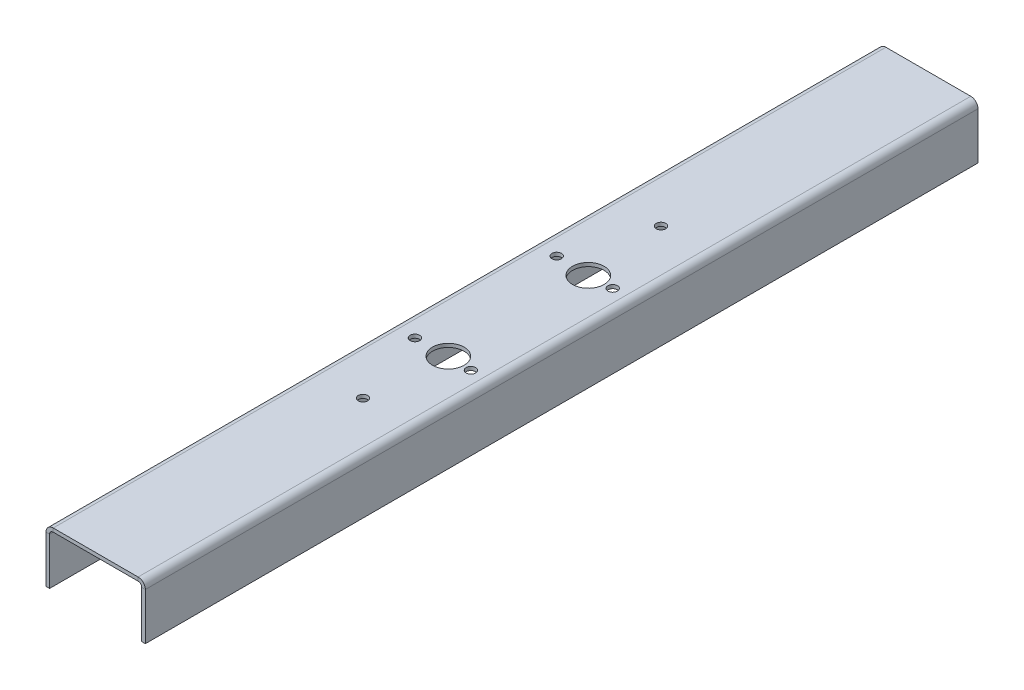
ISO-10303-21;
HEADER;
FILE_DESCRIPTION(('STEP AP214'),'2;1');
FILE_NAME('part.step','',(''),(''),'','','');
FILE_SCHEMA(('AUTOMOTIVE_DESIGN { 1 0 10303 214 1 1 1 1 }'));
ENDSEC;
DATA;
#1=APPLICATION_CONTEXT('core data for automotive mechanical design processes');
#2=APPLICATION_PROTOCOL_DEFINITION('international standard','automotive_design',2000,#1);
#3=PRODUCT_CONTEXT('',#1,'mechanical');
#4=PRODUCT('Part','Part','',(#3));
#5=PRODUCT_RELATED_PRODUCT_CATEGORY('part','',(#4));
#6=PRODUCT_DEFINITION_FORMATION('','',#4);
#7=PRODUCT_DEFINITION_CONTEXT('part definition',#1,'design');
#8=PRODUCT_DEFINITION('design','',#6,#7);
#9=PRODUCT_DEFINITION_SHAPE('','',#8);
#10=(LENGTH_UNIT() NAMED_UNIT(*) SI_UNIT(.MILLI.,.METRE.));
#11=(NAMED_UNIT(*) PLANE_ANGLE_UNIT() SI_UNIT($,.RADIAN.));
#12=(NAMED_UNIT(*) SI_UNIT($,.STERADIAN.) SOLID_ANGLE_UNIT());
#13=UNCERTAINTY_MEASURE_WITH_UNIT(LENGTH_MEASURE(1.E-05),#10,'distance_accuracy_value','');
#14=(GEOMETRIC_REPRESENTATION_CONTEXT(3) GLOBAL_UNCERTAINTY_ASSIGNED_CONTEXT((#13)) GLOBAL_UNIT_ASSIGNED_CONTEXT((#10,
#11,#12)) REPRESENTATION_CONTEXT('',''));
#15=CARTESIAN_POINT('',(0.,0.,0.));
#16=DIRECTION('',(0.,0.,1.));
#17=DIRECTION('',(1.,0.,0.));
#18=AXIS2_PLACEMENT_3D('',#15,#16,#17);
#19=CARTESIAN_POINT('',(55.0000000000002,-7.99999999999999,461.));
#20=DIRECTION('',(0.,0.,1.));
#21=DIRECTION('',(1.,0.,0.));
#22=AXIS2_PLACEMENT_3D('',#19,#20,#21);
#23=PLANE('',#22);
#24=DIRECTION('',(-1.,0.,0.));
#25=VECTOR('',#24,1.);
#26=CARTESIAN_POINT('',(55.0000000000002,-7.99999999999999,461.));
#27=LINE('',#26,#25);
#28=CARTESIAN_POINT('',(55.0000000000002,-7.99999999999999,461.));
#29=VERTEX_POINT('',#28);
#30=CARTESIAN_POINT('',(51.0000000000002,-7.99999999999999,461.));
#31=VERTEX_POINT('',#30);
#32=EDGE_CURVE('E11',#29,#31,#27,.T.);
#33=ORIENTED_EDGE('',*,*,#32,.F.);
#34=CARTESIAN_POINT('',(47.0000000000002,-7.99999999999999,461.));
#35=DIRECTION('',(0.,0.,-1.));
#36=DIRECTION('',(-1.,0.,0.));
#37=AXIS2_PLACEMENT_3D('',#34,#35,#36);
#38=CIRCLE('',#37,8.);
#39=CARTESIAN_POINT('',(47.0000000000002,0.,461.));
#40=VERTEX_POINT('',#39);
#41=EDGE_CURVE('E247',#29,#40,#38,.F.);
#42=ORIENTED_EDGE('',*,*,#41,.T.);
#43=DIRECTION('',(0.,1.,0.));
#44=VECTOR('',#43,1.);
#45=CARTESIAN_POINT('',(47.0000000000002,-3.99999999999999,461.));
#46=LINE('',#45,#44);
#47=CARTESIAN_POINT('',(47.0000000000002,-3.99999999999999,461.));
#48=VERTEX_POINT('',#47);
#49=EDGE_CURVE('E62',#48,#40,#46,.T.);
#50=ORIENTED_EDGE('',*,*,#49,.F.);
#51=CARTESIAN_POINT('',(47.0000000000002,-7.99999999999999,461.));
#52=DIRECTION('',(0.,0.,1.));
#53=DIRECTION('',(1.,0.,0.));
#54=AXIS2_PLACEMENT_3D('',#51,#52,#53);
#55=CIRCLE('',#54,4.);
#56=EDGE_CURVE('E231',#31,#48,#55,.T.);
#57=ORIENTED_EDGE('',*,*,#56,.F.);
#58=EDGE_LOOP('',(#33,#42,#50,#57));
#59=FACE_BOUND('',#58,.T.);
#60=ADVANCED_FACE('F54',(#59),#23,.T.);
#61=CARTESIAN_POINT('',(47.0000000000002,-3.99999999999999,461.));
#62=DIRECTION('',(0.,0.,1.));
#63=DIRECTION('',(1.,0.,0.));
#64=AXIS2_PLACEMENT_3D('',#61,#62,#63);
#65=PLANE('',#64);
#66=DIRECTION('',(0.,1.,0.));
#67=VECTOR('',#66,1.);
#68=CARTESIAN_POINT('',(55.0000000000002,0.,461.));
#69=LINE('',#68,#67);
#70=CARTESIAN_POINT('',(55.0000000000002,-60.,461.));
#71=VERTEX_POINT('',#70);
#72=EDGE_CURVE('E243',#71,#29,#69,.T.);
#73=ORIENTED_EDGE('',*,*,#72,.T.);
#74=ORIENTED_EDGE('',*,*,#32,.T.);
#75=DIRECTION('',(0.,1.,0.));
#76=VECTOR('',#75,1.);
#77=CARTESIAN_POINT('',(51.0000000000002,0.,461.));
#78=LINE('',#77,#76);
#79=CARTESIAN_POINT('',(51.0000000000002,-60.,461.));
#80=VERTEX_POINT('',#79);
#81=EDGE_CURVE('E235',#80,#31,#78,.T.);
#82=ORIENTED_EDGE('',*,*,#81,.F.);
#83=DIRECTION('',(-1.,0.,0.));
#84=VECTOR('',#83,1.);
#85=CARTESIAN_POINT('',(55.0000000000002,-60.,461.));
#86=LINE('',#85,#84);
#87=EDGE_CURVE('E239',#71,#80,#86,.T.);
#88=ORIENTED_EDGE('',*,*,#87,.F.);
#89=EDGE_LOOP('',(#73,#74,#82,#88));
#90=FACE_BOUND('',#89,.T.);
#91=ADVANCED_FACE('F351',(#90),#65,.T.);
#92=CARTESIAN_POINT('',(46.9999999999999,0.,-461.));
#93=DIRECTION('',(0.,0.,-1.));
#94=DIRECTION('',(-1.,0.,0.));
#95=AXIS2_PLACEMENT_3D('',#92,#93,#94);
#96=PLANE('',#95);
#97=DIRECTION('',(0.,-1.,0.));
#98=VECTOR('',#97,1.);
#99=CARTESIAN_POINT('',(46.9999999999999,0.,-461.));
#100=LINE('',#99,#98);
#101=CARTESIAN_POINT('',(46.9999999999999,0.,-461.));
#102=VERTEX_POINT('',#101);
#103=CARTESIAN_POINT('',(46.9999999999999,-3.99999999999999,-461.));
#104=VERTEX_POINT('',#103);
#105=EDGE_CURVE('E305',#102,#104,#100,.T.);
#106=ORIENTED_EDGE('',*,*,#105,.F.);
#107=CARTESIAN_POINT('',(46.9999999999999,-7.99999999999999,-461.));
#108=DIRECTION('',(0.,0.,-1.));
#109=DIRECTION('',(-1.,0.,0.));
#110=AXIS2_PLACEMENT_3D('',#107,#108,#109);
#111=CIRCLE('',#110,8.);
#112=CARTESIAN_POINT('',(54.9999999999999,-7.99999999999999,-461.));
#113=VERTEX_POINT('',#112);
#114=EDGE_CURVE('E202',#113,#102,#111,.F.);
#115=ORIENTED_EDGE('',*,*,#114,.F.);
#116=DIRECTION('',(1.,0.,0.));
#117=VECTOR('',#116,1.);
#118=CARTESIAN_POINT('',(50.9999999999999,-7.99999999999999,-461.));
#119=LINE('',#118,#117);
#120=CARTESIAN_POINT('',(50.9999999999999,-7.99999999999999,-461.));
#121=VERTEX_POINT('',#120);
#122=EDGE_CURVE('E302',#121,#113,#119,.T.);
#123=ORIENTED_EDGE('',*,*,#122,.F.);
#124=CARTESIAN_POINT('',(46.9999999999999,-7.99999999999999,-461.));
#125=DIRECTION('',(0.,0.,1.));
#126=DIRECTION('',(1.,0.,0.));
#127=AXIS2_PLACEMENT_3D('',#124,#125,#126);
#128=CIRCLE('',#127,4.);
#129=EDGE_CURVE('E186',#121,#104,#128,.T.);
#130=ORIENTED_EDGE('',*,*,#129,.T.);
#131=EDGE_LOOP('',(#106,#115,#123,#130));
#132=FACE_BOUND('',#131,.T.);
#133=ADVANCED_FACE('F361',(#132),#96,.T.);
#134=CARTESIAN_POINT('',(50.9999999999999,-7.99999999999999,-461.));
#135=DIRECTION('',(0.,0.,-1.));
#136=DIRECTION('',(-1.,0.,0.));
#137=AXIS2_PLACEMENT_3D('',#134,#135,#136);
#138=PLANE('',#137);
#139=DIRECTION('',(-1.,0.,0.));
#140=VECTOR('',#139,1.);
#141=CARTESIAN_POINT('',(-55.0000000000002,0.,-461.));
#142=LINE('',#141,#140);
#143=CARTESIAN_POINT('',(-47.0000000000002,0.,-461.));
#144=VERTEX_POINT('',#143);
#145=EDGE_CURVE('E206',#102,#144,#142,.T.);
#146=ORIENTED_EDGE('',*,*,#145,.F.);
#147=ORIENTED_EDGE('',*,*,#105,.T.);
#148=DIRECTION('',(-1.,0.,0.));
#149=VECTOR('',#148,1.);
#150=CARTESIAN_POINT('',(-55.0000000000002,-4.,-461.));
#151=LINE('',#150,#149);
#152=CARTESIAN_POINT('',(-47.0000000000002,-4.,-461.));
#153=VERTEX_POINT('',#152);
#154=EDGE_CURVE('E182',#104,#153,#151,.T.);
#155=ORIENTED_EDGE('',*,*,#154,.T.);
#156=DIRECTION('',(0.,1.,0.));
#157=VECTOR('',#156,1.);
#158=CARTESIAN_POINT('',(-47.0000000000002,-4.,-461.));
#159=LINE('',#158,#157);
#160=EDGE_CURVE('E154',#153,#144,#159,.T.);
#161=ORIENTED_EDGE('',*,*,#160,.T.);
#162=EDGE_LOOP('',(#146,#147,#155,#161));
#163=FACE_BOUND('',#162,.T.);
#164=ADVANCED_FACE('F363',(#163),#138,.T.);
#165=CARTESIAN_POINT('',(-46.9999999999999,0.,461.));
#166=DIRECTION('',(0.,0.,1.));
#167=DIRECTION('',(1.,0.,0.));
#168=AXIS2_PLACEMENT_3D('',#165,#166,#167);
#169=PLANE('',#168);
#170=DIRECTION('',(0.,-1.,0.));
#171=VECTOR('',#170,1.);
#172=CARTESIAN_POINT('',(-46.9999999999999,0.,461.));
#173=LINE('',#172,#171);
#174=CARTESIAN_POINT('',(-46.9999999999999,0.,461.));
#175=VERTEX_POINT('',#174);
#176=CARTESIAN_POINT('',(-46.9999999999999,-4.,461.));
#177=VERTEX_POINT('',#176);
#178=EDGE_CURVE('E76',#175,#177,#173,.T.);
#179=ORIENTED_EDGE('',*,*,#178,.F.);
#180=CARTESIAN_POINT('',(-46.9999999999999,-8.,461.));
#181=DIRECTION('',(0.,0.,-1.));
#182=DIRECTION('',(-1.,0.,0.));
#183=AXIS2_PLACEMENT_3D('',#180,#181,#182);
#184=CIRCLE('',#183,8.);
#185=CARTESIAN_POINT('',(-54.9999999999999,-8.,461.));
#186=VERTEX_POINT('',#185);
#187=EDGE_CURVE('E254',#175,#186,#184,.F.);
#188=ORIENTED_EDGE('',*,*,#187,.T.);
#189=DIRECTION('',(-1.,0.,0.));
#190=VECTOR('',#189,1.);
#191=CARTESIAN_POINT('',(-50.9999999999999,-8.,461.));
#192=LINE('',#191,#190);
#193=CARTESIAN_POINT('',(-50.9999999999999,-8.,461.));
#194=VERTEX_POINT('',#193);
#195=EDGE_CURVE('E69',#194,#186,#192,.T.);
#196=ORIENTED_EDGE('',*,*,#195,.F.);
#197=CARTESIAN_POINT('',(-46.9999999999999,-8.,461.));
#198=DIRECTION('',(0.,0.,1.));
#199=DIRECTION('',(1.,0.,0.));
#200=AXIS2_PLACEMENT_3D('',#197,#198,#199);
#201=CIRCLE('',#200,4.);
#202=EDGE_CURVE('E223',#177,#194,#201,.T.);
#203=ORIENTED_EDGE('',*,*,#202,.F.);
#204=EDGE_LOOP('',(#179,#188,#196,#203));
#205=FACE_BOUND('',#204,.T.);
#206=ADVANCED_FACE('F329',(#205),#169,.T.);
#207=CARTESIAN_POINT('',(-50.9999999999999,-8.,461.));
#208=DIRECTION('',(0.,0.,1.));
#209=DIRECTION('',(1.,0.,0.));
#210=AXIS2_PLACEMENT_3D('',#207,#208,#209);
#211=PLANE('',#210);
#212=DIRECTION('',(-1.,0.,0.));
#213=VECTOR('',#212,1.);
#214=CARTESIAN_POINT('',(-54.9999999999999,0.,461.));
#215=LINE('',#214,#213);
#216=EDGE_CURVE('E251',#40,#175,#215,.T.);
#217=ORIENTED_EDGE('',*,*,#216,.T.);
#218=ORIENTED_EDGE('',*,*,#178,.T.);
#219=DIRECTION('',(-1.,0.,0.));
#220=VECTOR('',#219,1.);
#221=CARTESIAN_POINT('',(-54.9999999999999,-4.,461.));
#222=LINE('',#221,#220);
#223=EDGE_CURVE('E227',#48,#177,#222,.T.);
#224=ORIENTED_EDGE('',*,*,#223,.F.);
#225=ORIENTED_EDGE('',*,*,#49,.T.);
#226=EDGE_LOOP('',(#217,#218,#224,#225));
#227=FACE_BOUND('',#226,.T.);
#228=ADVANCED_FACE('F311',(#227),#211,.T.);
#229=CARTESIAN_POINT('',(-55.0000000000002,-8.,-461.));
#230=DIRECTION('',(0.,0.,-1.));
#231=DIRECTION('',(-1.,0.,0.));
#232=AXIS2_PLACEMENT_3D('',#229,#230,#231);
#233=PLANE('',#232);
#234=DIRECTION('',(1.,0.,0.));
#235=VECTOR('',#234,1.);
#236=CARTESIAN_POINT('',(-55.0000000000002,-8.,-461.));
#237=LINE('',#236,#235);
#238=CARTESIAN_POINT('',(-55.0000000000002,-8.,-461.));
#239=VERTEX_POINT('',#238);
#240=CARTESIAN_POINT('',(-51.0000000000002,-8.,-461.));
#241=VERTEX_POINT('',#240);
#242=EDGE_CURVE('E295',#239,#241,#237,.T.);
#243=ORIENTED_EDGE('',*,*,#242,.F.);
#244=CARTESIAN_POINT('',(-47.0000000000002,-8.,-461.));
#245=DIRECTION('',(0.,0.,-1.));
#246=DIRECTION('',(-1.,0.,0.));
#247=AXIS2_PLACEMENT_3D('',#244,#245,#246);
#248=CIRCLE('',#247,8.);
#249=EDGE_CURVE('E210',#144,#239,#248,.F.);
#250=ORIENTED_EDGE('',*,*,#249,.F.);
#251=ORIENTED_EDGE('',*,*,#160,.F.);
#252=CARTESIAN_POINT('',(-47.0000000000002,-8.,-461.));
#253=DIRECTION('',(0.,0.,1.));
#254=DIRECTION('',(1.,0.,0.));
#255=AXIS2_PLACEMENT_3D('',#252,#253,#254);
#256=CIRCLE('',#255,4.);
#257=EDGE_CURVE('E175',#153,#241,#256,.T.);
#258=ORIENTED_EDGE('',*,*,#257,.T.);
#259=EDGE_LOOP('',(#243,#250,#251,#258));
#260=FACE_BOUND('',#259,.T.);
#261=ADVANCED_FACE('F365',(#260),#233,.T.);
#262=CARTESIAN_POINT('',(-47.0000000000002,-4.,-461.));
#263=DIRECTION('',(0.,0.,-1.));
#264=DIRECTION('',(-1.,0.,0.));
#265=AXIS2_PLACEMENT_3D('',#262,#263,#264);
#266=PLANE('',#265);
#267=DIRECTION('',(0.,-1.,0.));
#268=VECTOR('',#267,1.);
#269=CARTESIAN_POINT('',(-55.0000000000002,0.,-461.));
#270=LINE('',#269,#268);
#271=CARTESIAN_POINT('',(-55.0000000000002,-60.,-461.));
#272=VERTEX_POINT('',#271);
#273=EDGE_CURVE('E159',#239,#272,#270,.T.);
#274=ORIENTED_EDGE('',*,*,#273,.F.);
#275=ORIENTED_EDGE('',*,*,#242,.T.);
#276=DIRECTION('',(0.,1.,0.));
#277=VECTOR('',#276,1.);
#278=CARTESIAN_POINT('',(-51.0000000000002,0.,-461.));
#279=LINE('',#278,#277);
#280=CARTESIAN_POINT('',(-51.0000000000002,-60.,-461.));
#281=VERTEX_POINT('',#280);
#282=EDGE_CURVE('E169',#241,#281,#279,.F.);
#283=ORIENTED_EDGE('',*,*,#282,.T.);
#284=DIRECTION('',(-1.,0.,0.));
#285=VECTOR('',#284,1.);
#286=CARTESIAN_POINT('',(-51.0000000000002,-60.,-461.));
#287=LINE('',#286,#285);
#288=EDGE_CURVE('E147',#281,#272,#287,.T.);
#289=ORIENTED_EDGE('',*,*,#288,.T.);
#290=EDGE_LOOP('',(#274,#275,#283,#289));
#291=FACE_BOUND('',#290,.T.);
#292=ADVANCED_FACE('F167',(#291),#266,.T.);
#293=CARTESIAN_POINT('',(-54.9999999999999,0.,461.));
#294=DIRECTION('',(1.,0.,0.));
#295=DIRECTION('',(0.,0.,-1.));
#296=AXIS2_PLACEMENT_3D('',#293,#294,#295);
#297=PLANE('',#296);
#298=ORIENTED_EDGE('',*,*,#273,.T.);
#299=DIRECTION('',(0.,0.,-1.));
#300=VECTOR('',#299,1.);
#301=CARTESIAN_POINT('',(-54.9999999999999,-60.,461.));
#302=LINE('',#301,#300);
#303=CARTESIAN_POINT('',(-54.9999999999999,-60.,461.));
#304=VERTEX_POINT('',#303);
#305=EDGE_CURVE('E143',#304,#272,#302,.T.);
#306=ORIENTED_EDGE('',*,*,#305,.F.);
#307=DIRECTION('',(0.,-1.,0.));
#308=VECTOR('',#307,1.);
#309=CARTESIAN_POINT('',(-54.9999999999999,0.,461.));
#310=LINE('',#309,#308);
#311=EDGE_CURVE('E214',#186,#304,#310,.T.);
#312=ORIENTED_EDGE('',*,*,#311,.F.);
#313=DIRECTION('',(0.,0.,-1.));
#314=VECTOR('',#313,1.);
#315=CARTESIAN_POINT('',(-54.9999999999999,-8.,461.));
#316=LINE('',#315,#314);
#317=EDGE_CURVE('E162',#186,#239,#316,.T.);
#318=ORIENTED_EDGE('',*,*,#317,.T.);
#319=EDGE_LOOP('',(#298,#306,#312,#318));
#320=FACE_BOUND('',#319,.T.);
#321=ADVANCED_FACE('F160',(#320),#297,.F.);
#322=CARTESIAN_POINT('',(-50.9999999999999,-60.,461.));
#323=DIRECTION('',(0.,-1.,0.));
#324=DIRECTION('',(0.,0.,-1.));
#325=AXIS2_PLACEMENT_3D('',#322,#323,#324);
#326=PLANE('',#325);
#327=ORIENTED_EDGE('',*,*,#288,.F.);
#328=DIRECTION('',(0.,0.,-1.));
#329=VECTOR('',#328,1.);
#330=CARTESIAN_POINT('',(-50.9999999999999,-60.,461.));
#331=LINE('',#330,#329);
#332=CARTESIAN_POINT('',(-50.9999999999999,-60.,461.));
#333=VERTEX_POINT('',#332);
#334=EDGE_CURVE('E155',#333,#281,#331,.T.);
#335=ORIENTED_EDGE('',*,*,#334,.F.);
#336=DIRECTION('',(-1.,0.,0.));
#337=VECTOR('',#336,1.);
#338=CARTESIAN_POINT('',(-50.9999999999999,-60.,461.));
#339=LINE('',#338,#337);
#340=EDGE_CURVE('E150',#333,#304,#339,.T.);
#341=ORIENTED_EDGE('',*,*,#340,.T.);
#342=ORIENTED_EDGE('',*,*,#305,.T.);
#343=EDGE_LOOP('',(#327,#335,#341,#342));
#344=FACE_BOUND('',#343,.T.);
#345=ADVANCED_FACE('F145',(#344),#326,.T.);
#346=CARTESIAN_POINT('',(-50.9999999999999,0.,461.));
#347=DIRECTION('',(1.,0.,0.));
#348=DIRECTION('',(0.,0.,-1.));
#349=AXIS2_PLACEMENT_3D('',#346,#347,#348);
#350=PLANE('',#349);
#351=ORIENTED_EDGE('',*,*,#282,.F.);
#352=DIRECTION('',(0.,0.,-1.));
#353=VECTOR('',#352,1.);
#354=CARTESIAN_POINT('',(-50.9999999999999,-8.,461.));
#355=LINE('',#354,#353);
#356=EDGE_CURVE('E289',#194,#241,#355,.T.);
#357=ORIENTED_EDGE('',*,*,#356,.F.);
#358=DIRECTION('',(0.,1.,0.));
#359=VECTOR('',#358,1.);
#360=CARTESIAN_POINT('',(-50.9999999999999,0.,461.));
#361=LINE('',#360,#359);
#362=EDGE_CURVE('E219',#194,#333,#361,.F.);
#363=ORIENTED_EDGE('',*,*,#362,.T.);
#364=ORIENTED_EDGE('',*,*,#334,.T.);
#365=EDGE_LOOP('',(#351,#357,#363,#364));
#366=FACE_BOUND('',#365,.T.);
#367=ADVANCED_FACE('F332',(#366),#350,.T.);
#368=CARTESIAN_POINT('',(-46.9999999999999,-8.,461.));
#369=DIRECTION('',(0.,0.,-1.));
#370=DIRECTION('',(-1.,0.,0.));
#371=AXIS2_PLACEMENT_3D('',#368,#369,#370);
#372=CYLINDRICAL_SURFACE('',#371,4.);
#373=ORIENTED_EDGE('',*,*,#257,.F.);
#374=DIRECTION('',(0.,0.,-1.));
#375=VECTOR('',#374,1.);
#376=CARTESIAN_POINT('',(-46.9999999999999,-4.,461.));
#377=LINE('',#376,#375);
#378=EDGE_CURVE('E285',#177,#153,#377,.T.);
#379=ORIENTED_EDGE('',*,*,#378,.F.);
#380=ORIENTED_EDGE('',*,*,#202,.T.);
#381=ORIENTED_EDGE('',*,*,#356,.T.);
#382=EDGE_LOOP('',(#373,#379,#380,#381));
#383=FACE_BOUND('',#382,.T.);
#384=ADVANCED_FACE('F337',(#383),#372,.F.);
#385=CARTESIAN_POINT('',(-54.9999999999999,-4.,461.));
#386=DIRECTION('',(0.,-1.,0.));
#387=DIRECTION('',(1.,0.,0.));
#388=AXIS2_PLACEMENT_3D('',#385,#386,#387);
#389=PLANE('',#388);
#390=CARTESIAN_POINT('',(2.22044604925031E-13,-3.99999999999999,-165.));
#391=DIRECTION('',(0.,-1.,0.));
#392=DIRECTION('',(1.,0.,0.));
#393=AXIS2_PLACEMENT_3D('',#390,#391,#392);
#394=CIRCLE('',#393,5.25);
#395=CARTESIAN_POINT('',(5.25000000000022,-3.99999999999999,-165.));
#396=VERTEX_POINT('',#395);
#397=EDGE_CURVE('E717',#396,#396,#394,.F.);
#398=ORIENTED_EDGE('',*,*,#397,.T.);
#399=EDGE_LOOP('',(#398));
#400=FACE_BOUND('',#399,.T.);
#401=CARTESIAN_POINT('',(0.,-3.99999999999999,165.));
#402=DIRECTION('',(0.,-1.,0.));
#403=DIRECTION('',(1.,0.,0.));
#404=AXIS2_PLACEMENT_3D('',#401,#402,#403);
#405=CIRCLE('',#404,5.25);
#406=CARTESIAN_POINT('',(5.25,-3.99999999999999,165.));
#407=VERTEX_POINT('',#406);
#408=EDGE_CURVE('E722',#407,#407,#405,.F.);
#409=ORIENTED_EDGE('',*,*,#408,.T.);
#410=EDGE_LOOP('',(#409));
#411=FACE_BOUND('',#410,.T.);
#412=CARTESIAN_POINT('',(-29.0000000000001,-4.,-78.5));
#413=DIRECTION('',(0.,-1.,0.));
#414=DIRECTION('',(1.,0.,0.));
#415=AXIS2_PLACEMENT_3D('',#412,#413,#414);
#416=CIRCLE('',#415,5.25);
#417=CARTESIAN_POINT('',(-23.7500000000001,-4.,-78.5));
#418=VERTEX_POINT('',#417);
#419=EDGE_CURVE('E732',#418,#418,#416,.F.);
#420=ORIENTED_EDGE('',*,*,#419,.T.);
#421=EDGE_LOOP('',(#420));
#422=FACE_BOUND('',#421,.T.);
#423=CARTESIAN_POINT('',(-28.9999999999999,-4.,78.5));
#424=DIRECTION('',(0.,-1.,0.));
#425=DIRECTION('',(1.,0.,0.));
#426=AXIS2_PLACEMENT_3D('',#423,#424,#425);
#427=CIRCLE('',#426,5.25);
#428=CARTESIAN_POINT('',(-23.7499999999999,-4.,78.5));
#429=VERTEX_POINT('',#428);
#430=EDGE_CURVE('E738',#429,#429,#427,.F.);
#431=ORIENTED_EDGE('',*,*,#430,.T.);
#432=EDGE_LOOP('',(#431));
#433=FACE_BOUND('',#432,.T.);
#434=CARTESIAN_POINT('',(32.9999999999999,-3.99999999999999,-78.5));
#435=DIRECTION('',(0.,-1.,0.));
#436=DIRECTION('',(1.,0.,0.));
#437=AXIS2_PLACEMENT_3D('',#434,#435,#436);
#438=CIRCLE('',#437,5.25);
#439=CARTESIAN_POINT('',(38.2499999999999,-3.99999999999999,-78.5));
#440=VERTEX_POINT('',#439);
#441=EDGE_CURVE('E746',#440,#440,#438,.F.);
#442=ORIENTED_EDGE('',*,*,#441,.T.);
#443=EDGE_LOOP('',(#442));
#444=FACE_BOUND('',#443,.T.);
#445=CARTESIAN_POINT('',(6.9999999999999,-3.99999999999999,-77.5));
#446=DIRECTION('',(0.,-1.,0.));
#447=DIRECTION('',(1.,0.,0.));
#448=AXIS2_PLACEMENT_3D('',#445,#446,#447);
#449=CIRCLE('',#448,17.5);
#450=CARTESIAN_POINT('',(24.4999999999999,-3.99999999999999,-77.5));
#451=VERTEX_POINT('',#450);
#452=EDGE_CURVE('E754',#451,#451,#449,.F.);
#453=ORIENTED_EDGE('',*,*,#452,.T.);
#454=EDGE_LOOP('',(#453));
#455=FACE_BOUND('',#454,.T.);
#456=CARTESIAN_POINT('',(33.0000000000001,-3.99999999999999,78.5));
#457=DIRECTION('',(0.,-1.,0.));
#458=DIRECTION('',(1.,0.,0.));
#459=AXIS2_PLACEMENT_3D('',#456,#457,#458);
#460=CIRCLE('',#459,5.25);
#461=CARTESIAN_POINT('',(38.2500000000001,-3.99999999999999,78.5));
#462=VERTEX_POINT('',#461);
#463=EDGE_CURVE('E762',#462,#462,#460,.F.);
#464=ORIENTED_EDGE('',*,*,#463,.T.);
#465=EDGE_LOOP('',(#464));
#466=FACE_BOUND('',#465,.T.);
#467=CARTESIAN_POINT('',(7.00000000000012,-3.99999999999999,77.5));
#468=DIRECTION('',(0.,-1.,0.));
#469=DIRECTION('',(1.,0.,0.));
#470=AXIS2_PLACEMENT_3D('',#467,#468,#469);
#471=CIRCLE('',#470,17.5);
#472=CARTESIAN_POINT('',(24.5000000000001,-3.99999999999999,77.5));
#473=VERTEX_POINT('',#472);
#474=EDGE_CURVE('E770',#473,#473,#471,.F.);
#475=ORIENTED_EDGE('',*,*,#474,.T.);
#476=EDGE_LOOP('',(#475));
#477=FACE_BOUND('',#476,.T.);
#478=ORIENTED_EDGE('',*,*,#154,.F.);
#479=DIRECTION('',(0.,0.,-1.));
#480=VECTOR('',#479,1.);
#481=CARTESIAN_POINT('',(47.0000000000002,-3.99999999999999,461.));
#482=LINE('',#481,#480);
#483=EDGE_CURVE('E281',#48,#104,#482,.T.);
#484=ORIENTED_EDGE('',*,*,#483,.F.);
#485=ORIENTED_EDGE('',*,*,#223,.T.);
#486=ORIENTED_EDGE('',*,*,#378,.T.);
#487=EDGE_LOOP('',(#478,#484,#485,#486));
#488=FACE_BOUND('',#487,.T.);
#489=ADVANCED_FACE('F340',(#400,#411,#422,#433,#444,#455,#466,#477,#488),#389,.T.);
#490=CARTESIAN_POINT('',(47.0000000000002,-7.99999999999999,461.));
#491=DIRECTION('',(0.,0.,-1.));
#492=DIRECTION('',(-1.,0.,0.));
#493=AXIS2_PLACEMENT_3D('',#490,#491,#492);
#494=CYLINDRICAL_SURFACE('',#493,4.);
#495=ORIENTED_EDGE('',*,*,#129,.F.);
#496=DIRECTION('',(0.,0.,-1.));
#497=VECTOR('',#496,1.);
#498=CARTESIAN_POINT('',(51.0000000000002,-7.99999999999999,461.));
#499=LINE('',#498,#497);
#500=EDGE_CURVE('E277',#31,#121,#499,.T.);
#501=ORIENTED_EDGE('',*,*,#500,.F.);
#502=ORIENTED_EDGE('',*,*,#56,.T.);
#503=ORIENTED_EDGE('',*,*,#483,.T.);
#504=EDGE_LOOP('',(#495,#501,#502,#503));
#505=FACE_BOUND('',#504,.T.);
#506=ADVANCED_FACE('F343',(#505),#494,.F.);
#507=CARTESIAN_POINT('',(51.0000000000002,0.,461.));
#508=DIRECTION('',(-1.,0.,0.));
#509=DIRECTION('',(0.,-1.,0.));
#510=AXIS2_PLACEMENT_3D('',#507,#508,#509);
#511=PLANE('',#510);
#512=DIRECTION('',(0.,1.,0.));
#513=VECTOR('',#512,1.);
#514=CARTESIAN_POINT('',(50.9999999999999,0.,-461.));
#515=LINE('',#514,#513);
#516=CARTESIAN_POINT('',(50.9999999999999,-60.,-461.));
#517=VERTEX_POINT('',#516);
#518=EDGE_CURVE('E190',#517,#121,#515,.T.);
#519=ORIENTED_EDGE('',*,*,#518,.F.);
#520=DIRECTION('',(0.,0.,-1.));
#521=VECTOR('',#520,1.);
#522=CARTESIAN_POINT('',(51.0000000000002,-60.,461.));
#523=LINE('',#522,#521);
#524=EDGE_CURVE('E274',#80,#517,#523,.T.);
#525=ORIENTED_EDGE('',*,*,#524,.F.);
#526=ORIENTED_EDGE('',*,*,#81,.T.);
#527=ORIENTED_EDGE('',*,*,#500,.T.);
#528=EDGE_LOOP('',(#519,#525,#526,#527));
#529=FACE_BOUND('',#528,.T.);
#530=ADVANCED_FACE('F348',(#529),#511,.T.);
#531=CARTESIAN_POINT('',(55.0000000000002,-60.,461.));
#532=DIRECTION('',(0.,-1.,0.));
#533=DIRECTION('',(0.,0.,-1.));
#534=AXIS2_PLACEMENT_3D('',#531,#532,#533);
#535=PLANE('',#534);
#536=DIRECTION('',(-1.,0.,0.));
#537=VECTOR('',#536,1.);
#538=CARTESIAN_POINT('',(54.9999999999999,-60.,-461.));
#539=LINE('',#538,#537);
#540=CARTESIAN_POINT('',(54.9999999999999,-60.,-461.));
#541=VERTEX_POINT('',#540);
#542=EDGE_CURVE('E194',#541,#517,#539,.T.);
#543=ORIENTED_EDGE('',*,*,#542,.F.);
#544=DIRECTION('',(0.,0.,-1.));
#545=VECTOR('',#544,1.);
#546=CARTESIAN_POINT('',(55.0000000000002,-60.,461.));
#547=LINE('',#546,#545);
#548=EDGE_CURVE('E271',#71,#541,#547,.T.);
#549=ORIENTED_EDGE('',*,*,#548,.F.);
#550=ORIENTED_EDGE('',*,*,#87,.T.);
#551=ORIENTED_EDGE('',*,*,#524,.T.);
#552=EDGE_LOOP('',(#543,#549,#550,#551));
#553=FACE_BOUND('',#552,.T.);
#554=ADVANCED_FACE('F354',(#553),#535,.T.);
#555=CARTESIAN_POINT('',(55.0000000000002,0.,461.));
#556=DIRECTION('',(-1.,0.,0.));
#557=DIRECTION('',(0.,-1.,0.));
#558=AXIS2_PLACEMENT_3D('',#555,#556,#557);
#559=PLANE('',#558);
#560=DIRECTION('',(0.,1.,0.));
#561=VECTOR('',#560,1.);
#562=CARTESIAN_POINT('',(54.9999999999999,0.,-461.));
#563=LINE('',#562,#561);
#564=EDGE_CURVE('E198',#541,#113,#563,.T.);
#565=ORIENTED_EDGE('',*,*,#564,.T.);
#566=DIRECTION('',(0.,0.,-1.));
#567=VECTOR('',#566,1.);
#568=CARTESIAN_POINT('',(55.0000000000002,-7.99999999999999,461.));
#569=LINE('',#568,#567);
#570=EDGE_CURVE('E267',#29,#113,#569,.T.);
#571=ORIENTED_EDGE('',*,*,#570,.F.);
#572=ORIENTED_EDGE('',*,*,#72,.F.);
#573=ORIENTED_EDGE('',*,*,#548,.T.);
#574=EDGE_LOOP('',(#565,#571,#572,#573));
#575=FACE_BOUND('',#574,.T.);
#576=ADVANCED_FACE('F359',(#575),#559,.F.);
#577=CARTESIAN_POINT('',(47.0000000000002,-7.99999999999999,461.));
#578=DIRECTION('',(0.,0.,-1.));
#579=DIRECTION('',(-1.,0.,0.));
#580=AXIS2_PLACEMENT_3D('',#577,#578,#579);
#581=CYLINDRICAL_SURFACE('',#580,8.);
#582=ORIENTED_EDGE('',*,*,#114,.T.);
#583=DIRECTION('',(0.,0.,-1.));
#584=VECTOR('',#583,1.);
#585=CARTESIAN_POINT('',(47.0000000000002,0.,461.));
#586=LINE('',#585,#584);
#587=EDGE_CURVE('E263',#40,#102,#586,.T.);
#588=ORIENTED_EDGE('',*,*,#587,.F.);
#589=ORIENTED_EDGE('',*,*,#41,.F.);
#590=ORIENTED_EDGE('',*,*,#570,.T.);
#591=EDGE_LOOP('',(#582,#588,#589,#590));
#592=FACE_BOUND('',#591,.T.);
#593=ADVANCED_FACE('F320',(#592),#581,.T.);
#594=CARTESIAN_POINT('',(-54.9999999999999,0.,461.));
#595=DIRECTION('',(0.,-1.,0.));
#596=DIRECTION('',(1.,0.,0.));
#597=AXIS2_PLACEMENT_3D('',#594,#595,#596);
#598=PLANE('',#597);
#599=CARTESIAN_POINT('',(2.22044604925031E-13,0.,-165.));
#600=DIRECTION('',(0.,1.,0.));
#601=DIRECTION('',(1.,0.,0.));
#602=AXIS2_PLACEMENT_3D('',#599,#600,#601);
#603=CIRCLE('',#602,5.25);
#604=CARTESIAN_POINT('',(5.25000000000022,0.,-165.));
#605=VERTEX_POINT('',#604);
#606=EDGE_CURVE('E720',#605,#605,#603,.T.);
#607=ORIENTED_EDGE('',*,*,#606,.F.);
#608=EDGE_LOOP('',(#607));
#609=FACE_BOUND('',#608,.T.);
#610=CARTESIAN_POINT('',(0.,0.,165.));
#611=DIRECTION('',(0.,1.,0.));
#612=DIRECTION('',(-1.,0.,0.));
#613=AXIS2_PLACEMENT_3D('',#610,#611,#612);
#614=CIRCLE('',#613,5.25);
#615=CARTESIAN_POINT('',(-5.25,0.,165.));
#616=VERTEX_POINT('',#615);
#617=EDGE_CURVE('E726',#616,#616,#614,.T.);
#618=ORIENTED_EDGE('',*,*,#617,.F.);
#619=EDGE_LOOP('',(#618));
#620=FACE_BOUND('',#619,.T.);
#621=CARTESIAN_POINT('',(-29.0000000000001,0.,-78.5));
#622=DIRECTION('',(0.,1.,0.));
#623=DIRECTION('',(1.,0.,0.));
#624=AXIS2_PLACEMENT_3D('',#621,#622,#623);
#625=CIRCLE('',#624,5.25);
#626=CARTESIAN_POINT('',(-23.7500000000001,0.,-78.5));
#627=VERTEX_POINT('',#626);
#628=EDGE_CURVE('E734',#627,#627,#625,.T.);
#629=ORIENTED_EDGE('',*,*,#628,.F.);
#630=EDGE_LOOP('',(#629));
#631=FACE_BOUND('',#630,.T.);
#632=CARTESIAN_POINT('',(-28.9999999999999,0.,78.5));
#633=DIRECTION('',(0.,1.,0.));
#634=DIRECTION('',(-1.,0.,0.));
#635=AXIS2_PLACEMENT_3D('',#632,#633,#634);
#636=CIRCLE('',#635,5.25);
#637=CARTESIAN_POINT('',(-34.2499999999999,0.,78.5));
#638=VERTEX_POINT('',#637);
#639=EDGE_CURVE('E742',#638,#638,#636,.T.);
#640=ORIENTED_EDGE('',*,*,#639,.F.);
#641=EDGE_LOOP('',(#640));
#642=FACE_BOUND('',#641,.T.);
#643=CARTESIAN_POINT('',(32.9999999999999,0.,-78.5));
#644=DIRECTION('',(0.,1.,0.));
#645=DIRECTION('',(1.,0.,0.));
#646=AXIS2_PLACEMENT_3D('',#643,#644,#645);
#647=CIRCLE('',#646,5.25);
#648=CARTESIAN_POINT('',(38.2499999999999,0.,-78.5));
#649=VERTEX_POINT('',#648);
#650=EDGE_CURVE('E750',#649,#649,#647,.T.);
#651=ORIENTED_EDGE('',*,*,#650,.F.);
#652=EDGE_LOOP('',(#651));
#653=FACE_BOUND('',#652,.T.);
#654=CARTESIAN_POINT('',(6.9999999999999,0.,-77.5));
#655=DIRECTION('',(0.,1.,0.));
#656=DIRECTION('',(1.,0.,0.));
#657=AXIS2_PLACEMENT_3D('',#654,#655,#656);
#658=CIRCLE('',#657,17.5);
#659=CARTESIAN_POINT('',(24.4999999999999,0.,-77.5));
#660=VERTEX_POINT('',#659);
#661=EDGE_CURVE('E758',#660,#660,#658,.T.);
#662=ORIENTED_EDGE('',*,*,#661,.F.);
#663=EDGE_LOOP('',(#662));
#664=FACE_BOUND('',#663,.T.);
#665=CARTESIAN_POINT('',(33.0000000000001,0.,78.5));
#666=DIRECTION('',(0.,1.,0.));
#667=DIRECTION('',(-1.,0.,0.));
#668=AXIS2_PLACEMENT_3D('',#665,#666,#667);
#669=CIRCLE('',#668,5.25);
#670=CARTESIAN_POINT('',(27.7500000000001,0.,78.5));
#671=VERTEX_POINT('',#670);
#672=EDGE_CURVE('E766',#671,#671,#669,.T.);
#673=ORIENTED_EDGE('',*,*,#672,.F.);
#674=EDGE_LOOP('',(#673));
#675=FACE_BOUND('',#674,.T.);
#676=CARTESIAN_POINT('',(7.00000000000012,0.,77.5));
#677=DIRECTION('',(0.,1.,0.));
#678=DIRECTION('',(-1.,0.,0.));
#679=AXIS2_PLACEMENT_3D('',#676,#677,#678);
#680=CIRCLE('',#679,17.5);
#681=CARTESIAN_POINT('',(-10.4999999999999,0.,77.5));
#682=VERTEX_POINT('',#681);
#683=EDGE_CURVE('E165',#682,#682,#680,.T.);
#684=ORIENTED_EDGE('',*,*,#683,.F.);
#685=EDGE_LOOP('',(#684));
#686=FACE_BOUND('',#685,.T.);
#687=ORIENTED_EDGE('',*,*,#145,.T.);
#688=DIRECTION('',(0.,0.,-1.));
#689=VECTOR('',#688,1.);
#690=CARTESIAN_POINT('',(-46.9999999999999,0.,461.));
#691=LINE('',#690,#689);
#692=EDGE_CURVE('E259',#175,#144,#691,.T.);
#693=ORIENTED_EDGE('',*,*,#692,.F.);
#694=ORIENTED_EDGE('',*,*,#216,.F.);
#695=ORIENTED_EDGE('',*,*,#587,.T.);
#696=EDGE_LOOP('',(#687,#693,#694,#695));
#697=FACE_BOUND('',#696,.T.);
#698=ADVANCED_FACE('F324',(#609,#620,#631,#642,#653,#664,#675,#686,#697),#598,.F.);
#699=CARTESIAN_POINT('',(-46.9999999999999,-8.,461.));
#700=DIRECTION('',(0.,0.,-1.));
#701=DIRECTION('',(-1.,0.,0.));
#702=AXIS2_PLACEMENT_3D('',#699,#700,#701);
#703=CYLINDRICAL_SURFACE('',#702,8.);
#704=ORIENTED_EDGE('',*,*,#249,.T.);
#705=ORIENTED_EDGE('',*,*,#317,.F.);
#706=ORIENTED_EDGE('',*,*,#187,.F.);
#707=ORIENTED_EDGE('',*,*,#692,.T.);
#708=EDGE_LOOP('',(#704,#705,#706,#707));
#709=FACE_BOUND('',#708,.T.);
#710=ADVANCED_FACE('F328',(#709),#703,.T.);
#711=CARTESIAN_POINT('',(-46.9999999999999,-8.,461.));
#712=DIRECTION('',(0.,0.,1.));
#713=DIRECTION('',(1.,0.,0.));
#714=AXIS2_PLACEMENT_3D('',#711,#712,#713);
#715=PLANE('',#714);
#716=ORIENTED_EDGE('',*,*,#311,.T.);
#717=ORIENTED_EDGE('',*,*,#340,.F.);
#718=ORIENTED_EDGE('',*,*,#362,.F.);
#719=ORIENTED_EDGE('',*,*,#195,.T.);
#720=EDGE_LOOP('',(#716,#717,#718,#719));
#721=FACE_BOUND('',#720,.T.);
#722=ADVANCED_FACE('F335',(#721),#715,.T.);
#723=CARTESIAN_POINT('',(-47.0000000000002,-8.,-461.));
#724=DIRECTION('',(0.,0.,1.));
#725=DIRECTION('',(1.,0.,0.));
#726=AXIS2_PLACEMENT_3D('',#723,#724,#725);
#727=PLANE('',#726);
#728=ORIENTED_EDGE('',*,*,#518,.T.);
#729=ORIENTED_EDGE('',*,*,#122,.T.);
#730=ORIENTED_EDGE('',*,*,#564,.F.);
#731=ORIENTED_EDGE('',*,*,#542,.T.);
#732=EDGE_LOOP('',(#728,#729,#730,#731));
#733=FACE_BOUND('',#732,.T.);
#734=ADVANCED_FACE('F494',(#733),#727,.F.);
#735=CARTESIAN_POINT('',(7.00000000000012,-60.001,77.5));
#736=DIRECTION('',(0.,1.,0.));
#737=DIRECTION('',(-1.,0.,0.));
#738=AXIS2_PLACEMENT_3D('',#735,#736,#737);
#739=CYLINDRICAL_SURFACE('',#738,17.5);
#740=ORIENTED_EDGE('',*,*,#474,.F.);
#741=EDGE_LOOP('',(#740));
#742=FACE_BOUND('',#741,.T.);
#743=ORIENTED_EDGE('',*,*,#683,.T.);
#744=EDGE_LOOP('',(#743));
#745=FACE_BOUND('',#744,.T.);
#746=ADVANCED_FACE('F502',(#742,#745),#739,.F.);
#747=CARTESIAN_POINT('',(33.0000000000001,-60.001,78.5));
#748=DIRECTION('',(0.,1.,0.));
#749=DIRECTION('',(-1.,0.,0.));
#750=AXIS2_PLACEMENT_3D('',#747,#748,#749);
#751=CYLINDRICAL_SURFACE('',#750,5.25);
#752=ORIENTED_EDGE('',*,*,#463,.F.);
#753=EDGE_LOOP('',(#752));
#754=FACE_BOUND('',#753,.T.);
#755=ORIENTED_EDGE('',*,*,#672,.T.);
#756=EDGE_LOOP('',(#755));
#757=FACE_BOUND('',#756,.T.);
#758=ADVANCED_FACE('F511',(#754,#757),#751,.F.);
#759=CARTESIAN_POINT('',(6.9999999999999,-60.001,-77.5));
#760=DIRECTION('',(0.,1.,0.));
#761=DIRECTION('',(-1.,0.,0.));
#762=AXIS2_PLACEMENT_3D('',#759,#760,#761);
#763=CYLINDRICAL_SURFACE('',#762,17.5);
#764=ORIENTED_EDGE('',*,*,#452,.F.);
#765=EDGE_LOOP('',(#764));
#766=FACE_BOUND('',#765,.T.);
#767=ORIENTED_EDGE('',*,*,#661,.T.);
#768=EDGE_LOOP('',(#767));
#769=FACE_BOUND('',#768,.T.);
#770=ADVANCED_FACE('F520',(#766,#769),#763,.F.);
#771=CARTESIAN_POINT('',(32.9999999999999,-60.001,-78.5));
#772=DIRECTION('',(0.,1.,0.));
#773=DIRECTION('',(-1.,0.,0.));
#774=AXIS2_PLACEMENT_3D('',#771,#772,#773);
#775=CYLINDRICAL_SURFACE('',#774,5.25);
#776=ORIENTED_EDGE('',*,*,#441,.F.);
#777=EDGE_LOOP('',(#776));
#778=FACE_BOUND('',#777,.T.);
#779=ORIENTED_EDGE('',*,*,#650,.T.);
#780=EDGE_LOOP('',(#779));
#781=FACE_BOUND('',#780,.T.);
#782=ADVANCED_FACE('F529',(#778,#781),#775,.F.);
#783=CARTESIAN_POINT('',(-28.9999999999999,-60.001,78.5));
#784=DIRECTION('',(0.,1.,0.));
#785=DIRECTION('',(-1.,0.,0.));
#786=AXIS2_PLACEMENT_3D('',#783,#784,#785);
#787=CYLINDRICAL_SURFACE('',#786,5.25);
#788=ORIENTED_EDGE('',*,*,#430,.F.);
#789=EDGE_LOOP('',(#788));
#790=FACE_BOUND('',#789,.T.);
#791=ORIENTED_EDGE('',*,*,#639,.T.);
#792=EDGE_LOOP('',(#791));
#793=FACE_BOUND('',#792,.T.);
#794=ADVANCED_FACE('F538',(#790,#793),#787,.F.);
#795=CARTESIAN_POINT('',(-29.0000000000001,-60.001,-78.5));
#796=DIRECTION('',(0.,1.,0.));
#797=DIRECTION('',(-1.,0.,0.));
#798=AXIS2_PLACEMENT_3D('',#795,#796,#797);
#799=CYLINDRICAL_SURFACE('',#798,5.25);
#800=ORIENTED_EDGE('',*,*,#419,.F.);
#801=EDGE_LOOP('',(#800));
#802=FACE_BOUND('',#801,.T.);
#803=ORIENTED_EDGE('',*,*,#628,.T.);
#804=EDGE_LOOP('',(#803));
#805=FACE_BOUND('',#804,.T.);
#806=ADVANCED_FACE('F547',(#802,#805),#799,.F.);
#807=CARTESIAN_POINT('',(0.,-60.001,165.));
#808=DIRECTION('',(0.,1.,0.));
#809=DIRECTION('',(-1.,0.,0.));
#810=AXIS2_PLACEMENT_3D('',#807,#808,#809);
#811=CYLINDRICAL_SURFACE('',#810,5.25);
#812=ORIENTED_EDGE('',*,*,#408,.F.);
#813=EDGE_LOOP('',(#812));
#814=FACE_BOUND('',#813,.T.);
#815=ORIENTED_EDGE('',*,*,#617,.T.);
#816=EDGE_LOOP('',(#815));
#817=FACE_BOUND('',#816,.T.);
#818=ADVANCED_FACE('F556',(#814,#817),#811,.F.);
#819=CARTESIAN_POINT('',(2.22044604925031E-13,-60.001,-165.));
#820=DIRECTION('',(0.,1.,0.));
#821=DIRECTION('',(-1.,0.,0.));
#822=AXIS2_PLACEMENT_3D('',#819,#820,#821);
#823=CYLINDRICAL_SURFACE('',#822,5.25);
#824=ORIENTED_EDGE('',*,*,#397,.F.);
#825=EDGE_LOOP('',(#824));
#826=FACE_BOUND('',#825,.T.);
#827=ORIENTED_EDGE('',*,*,#606,.T.);
#828=EDGE_LOOP('',(#827));
#829=FACE_BOUND('',#828,.T.);
#830=ADVANCED_FACE('F565',(#826,#829),#823,.F.);
#831=CLOSED_SHELL('',(#60,#91,#133,#164,#206,#228,#261,#292,#321,#345,#367,#384,#489,#506,#530,
#554,#576,#593,#698,#710,#722,#734,#746,#758,#770,#782,#794,#806,#818,#830));
#832=MANIFOLD_SOLID_BREP('B2',#831);
#833=ADVANCED_BREP_SHAPE_REPRESENTATION('',(#18,#832),#14);
#834=SHAPE_DEFINITION_REPRESENTATION(#9,#833);
ENDSEC;
END-ISO-10303-21;
